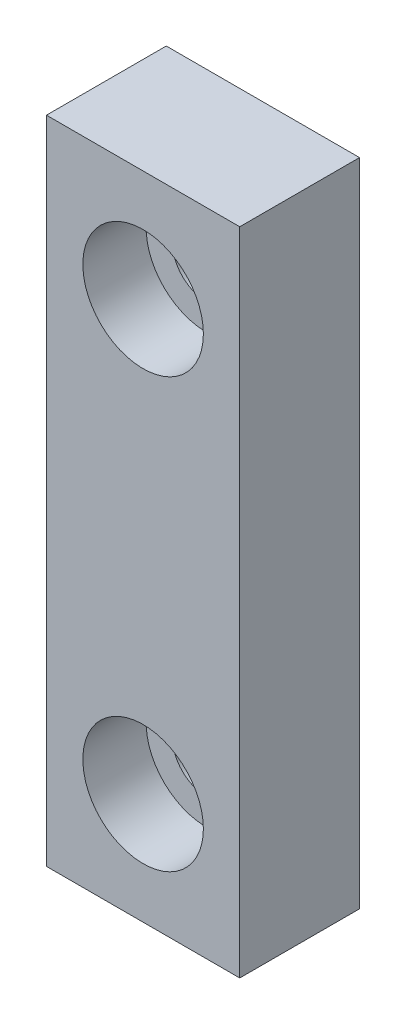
from build123d import *

# Parameters (mm, degrees)
SKETCH1_W                      = 12.827
SKETCH1_H                      = 43.18
EXTRUDE1_DEPTH                 = 3.9751
CBORE_FOR_M4_SHCS1_D           = 4.5
CBORE_FOR_M4_SHCS1_CBORE_D     = 8
CBORE_FOR_M4_SHCS1_CBORE_DEPTH = 4.2


with BuildPart() as part:
    # Sketch1 → Extrude1 (new, symmetric)
    with BuildSketch(Plane.XY):
        Rectangle(SKETCH1_W, SKETCH1_H)
    extrude(amount=EXTRUDE1_DEPTH, both=True)

    # CBORE for M4 SHCS1 (through all)
    with Locations(Plane.XY.offset(3.9751)):
        with Locations((0, 14.224), (0, -14.224)):
            CounterBoreHole(CBORE_FOR_M4_SHCS1_D / 2, CBORE_FOR_M4_SHCS1_CBORE_D / 2, CBORE_FOR_M4_SHCS1_CBORE_DEPTH)


solid = part.part
